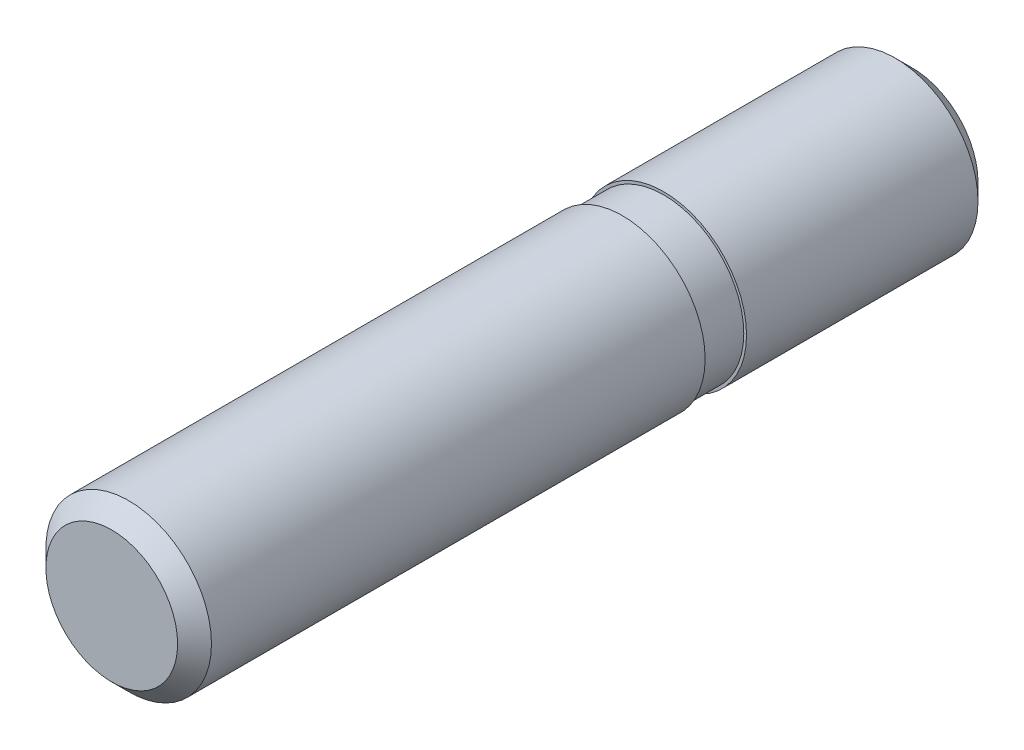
ISO-10303-21;
HEADER;
FILE_DESCRIPTION(('STEP AP214'),'2;1');
FILE_NAME('part.step','',(''),(''),'','','');
FILE_SCHEMA(('AUTOMOTIVE_DESIGN { 1 0 10303 214 1 1 1 1 }'));
ENDSEC;
DATA;
#1=APPLICATION_CONTEXT('core data for automotive mechanical design processes');
#2=APPLICATION_PROTOCOL_DEFINITION('international standard','automotive_design',2000,#1);
#3=PRODUCT_CONTEXT('',#1,'mechanical');
#4=PRODUCT('Part','Part','',(#3));
#5=PRODUCT_RELATED_PRODUCT_CATEGORY('part','',(#4));
#6=PRODUCT_DEFINITION_FORMATION('','',#4);
#7=PRODUCT_DEFINITION_CONTEXT('part definition',#1,'design');
#8=PRODUCT_DEFINITION('design','',#6,#7);
#9=PRODUCT_DEFINITION_SHAPE('','',#8);
#10=(LENGTH_UNIT() NAMED_UNIT(*) SI_UNIT(.MILLI.,.METRE.));
#11=(NAMED_UNIT(*) PLANE_ANGLE_UNIT() SI_UNIT($,.RADIAN.));
#12=(NAMED_UNIT(*) SI_UNIT($,.STERADIAN.) SOLID_ANGLE_UNIT());
#13=UNCERTAINTY_MEASURE_WITH_UNIT(LENGTH_MEASURE(1.E-05),#10,'distance_accuracy_value','');
#14=(GEOMETRIC_REPRESENTATION_CONTEXT(3) GLOBAL_UNCERTAINTY_ASSIGNED_CONTEXT((#13)) GLOBAL_UNIT_ASSIGNED_CONTEXT((#10,
#11,#12)) REPRESENTATION_CONTEXT('',''));
#15=CARTESIAN_POINT('',(0.,0.,0.));
#16=DIRECTION('',(0.,0.,1.));
#17=DIRECTION('',(1.,0.,0.));
#18=AXIS2_PLACEMENT_3D('',#15,#16,#17);
#19=CARTESIAN_POINT('',(0.,0.,6.25));
#20=DIRECTION('',(0.,0.,1.));
#21=DIRECTION('',(1.,0.,0.));
#22=AXIS2_PLACEMENT_3D('',#19,#20,#21);
#23=CYLINDRICAL_SURFACE('',#22,3.);
#24=CARTESIAN_POINT('',(0.,0.,19.3865));
#25=DIRECTION('',(0.,0.,1.));
#26=DIRECTION('',(1.,0.,0.));
#27=AXIS2_PLACEMENT_3D('',#24,#25,#26);
#28=CIRCLE('',#27,3.);
#29=CARTESIAN_POINT('',(3.,0.,19.3865));
#30=VERTEX_POINT('',#29);
#31=EDGE_CURVE('E18',#30,#30,#28,.F.);
#32=ORIENTED_EDGE('',*,*,#31,.T.);
#33=EDGE_LOOP('',(#32));
#34=FACE_BOUND('',#33,.T.);
#35=CARTESIAN_POINT('',(0.,0.,1.5));
#36=DIRECTION('',(0.,0.,1.));
#37=DIRECTION('',(1.,0.,0.));
#38=AXIS2_PLACEMENT_3D('',#35,#36,#37);
#39=CIRCLE('',#38,3.);
#40=CARTESIAN_POINT('',(3.,0.,1.5));
#41=VERTEX_POINT('',#40);
#42=EDGE_CURVE('E26',#41,#41,#39,.T.);
#43=ORIENTED_EDGE('',*,*,#42,.T.);
#44=EDGE_LOOP('',(#43));
#45=FACE_BOUND('',#44,.T.);
#46=ADVANCED_FACE('F12',(#34,#45),#23,.T.);
#47=CARTESIAN_POINT('',(0.,0.,1.5));
#48=DIRECTION('',(0.,0.,1.));
#49=DIRECTION('',(1.,0.,0.));
#50=AXIS2_PLACEMENT_3D('',#47,#48,#49);
#51=PLANE('',#50);
#52=CARTESIAN_POINT('',(0.,0.,1.5));
#53=DIRECTION('',(0.,0.,-1.));
#54=DIRECTION('',(-1.,0.,0.));
#55=AXIS2_PLACEMENT_3D('',#52,#53,#54);
#56=CIRCLE('',#55,2.9);
#57=CARTESIAN_POINT('',(-2.9,0.,1.5));
#58=VERTEX_POINT('',#57);
#59=EDGE_CURVE('E33',#58,#58,#56,.T.);
#60=ORIENTED_EDGE('',*,*,#59,.F.);
#61=EDGE_LOOP('',(#60));
#62=FACE_BOUND('',#61,.T.);
#63=ORIENTED_EDGE('',*,*,#42,.F.);
#64=EDGE_LOOP('',(#63));
#65=FACE_BOUND('',#64,.T.);
#66=ADVANCED_FACE('F46',(#62,#65),#51,.F.);
#67=CARTESIAN_POINT('',(0.,0.,20.));
#68=DIRECTION('',(0.,0.,1.));
#69=DIRECTION('',(1.,0.,0.));
#70=AXIS2_PLACEMENT_3D('',#67,#68,#69);
#71=PLANE('',#70);
#72=CARTESIAN_POINT('',(0.,0.,20.));
#73=DIRECTION('',(0.,0.,1.));
#74=DIRECTION('',(1.,0.,0.));
#75=AXIS2_PLACEMENT_3D('',#72,#73,#74);
#76=CIRCLE('',#75,2.3865);
#77=CARTESIAN_POINT('',(2.3865,0.,20.));
#78=VERTEX_POINT('',#77);
#79=EDGE_CURVE('E22',#78,#78,#76,.T.);
#80=ORIENTED_EDGE('',*,*,#79,.T.);
#81=EDGE_LOOP('',(#80));
#82=FACE_BOUND('',#81,.T.);
#83=ADVANCED_FACE('F49',(#82),#71,.T.);
#84=CARTESIAN_POINT('',(0.,0.,20.));
#85=DIRECTION('',(0.,0.,-1.));
#86=DIRECTION('',(-1.,0.,0.));
#87=AXIS2_PLACEMENT_3D('',#84,#85,#86);
#88=CONICAL_SURFACE('',#87,2.3865,0.785398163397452);
#89=ORIENTED_EDGE('',*,*,#31,.F.);
#90=EDGE_LOOP('',(#89));
#91=FACE_BOUND('',#90,.T.);
#92=ORIENTED_EDGE('',*,*,#79,.F.);
#93=EDGE_LOOP('',(#92));
#94=FACE_BOUND('',#93,.T.);
#95=ADVANCED_FACE('F72',(#91,#94),#88,.T.);
#96=CARTESIAN_POINT('',(0.,0.,-2.51140945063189));
#97=DIRECTION('',(0.,0.,-1.));
#98=DIRECTION('',(-1.,0.,0.));
#99=AXIS2_PLACEMENT_3D('',#96,#97,#98);
#100=CYLINDRICAL_SURFACE('',#99,2.9);
#101=ORIENTED_EDGE('',*,*,#59,.T.);
#102=EDGE_LOOP('',(#101));
#103=FACE_BOUND('',#102,.T.);
#104=CARTESIAN_POINT('',(0.,0.,0.));
#105=DIRECTION('',(0.,0.,1.));
#106=DIRECTION('',(1.,0.,0.));
#107=AXIS2_PLACEMENT_3D('',#104,#105,#106);
#108=CIRCLE('',#107,2.9);
#109=CARTESIAN_POINT('',(2.9,0.,0.));
#110=VERTEX_POINT('',#109);
#111=EDGE_CURVE('E8',#110,#110,#108,.T.);
#112=ORIENTED_EDGE('',*,*,#111,.T.);
#113=EDGE_LOOP('',(#112));
#114=FACE_BOUND('',#113,.T.);
#115=ADVANCED_FACE('F44',(#103,#114),#100,.T.);
#116=CARTESIAN_POINT('',(0.,1.19325,-9.));
#117=DIRECTION('',(0.,0.,-1.));
#118=DIRECTION('',(-1.,0.,0.));
#119=AXIS2_PLACEMENT_3D('',#116,#117,#118);
#120=PLANE('',#119);
#121=CARTESIAN_POINT('',(0.,0.,-9.));
#122=DIRECTION('',(0.,0.,1.));
#123=DIRECTION('',(1.,0.,0.));
#124=AXIS2_PLACEMENT_3D('',#121,#122,#123);
#125=CIRCLE('',#124,2.38649999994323);
#126=CARTESIAN_POINT('',(2.38649999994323,0.,-9.));
#127=VERTEX_POINT('',#126);
#128=EDGE_CURVE('E29',#127,#127,#125,.T.);
#129=ORIENTED_EDGE('',*,*,#128,.F.);
#130=EDGE_LOOP('',(#129));
#131=FACE_BOUND('',#130,.T.);
#132=ADVANCED_FACE('F89',(#131),#120,.T.);
#133=CARTESIAN_POINT('',(0.,0.,-8.38649999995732));
#134=DIRECTION('',(0.,0.,1.));
#135=DIRECTION('',(1.,0.,0.));
#136=AXIS2_PLACEMENT_3D('',#133,#134,#135);
#137=CONICAL_SURFACE('',#136,2.99999999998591,0.785398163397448);
#138=CARTESIAN_POINT('',(0.,0.,-8.3865));
#139=DIRECTION('',(0.,0.,1.));
#140=DIRECTION('',(1.,0.,0.));
#141=AXIS2_PLACEMENT_3D('',#138,#139,#140);
#142=CIRCLE('',#141,3.);
#143=CARTESIAN_POINT('',(3.,0.,-8.3865));
#144=VERTEX_POINT('',#143);
#145=EDGE_CURVE('E32',#144,#144,#142,.T.);
#146=ORIENTED_EDGE('',*,*,#145,.F.);
#147=EDGE_LOOP('',(#146));
#148=FACE_BOUND('',#147,.T.);
#149=ORIENTED_EDGE('',*,*,#128,.T.);
#150=EDGE_LOOP('',(#149));
#151=FACE_BOUND('',#150,.T.);
#152=ADVANCED_FACE('F97',(#148,#151),#137,.T.);
#153=CARTESIAN_POINT('',(0.,0.,6.25));
#154=DIRECTION('',(0.,0.,1.));
#155=DIRECTION('',(1.,0.,0.));
#156=AXIS2_PLACEMENT_3D('',#153,#154,#155);
#157=CYLINDRICAL_SURFACE('',#156,3.);
#158=CARTESIAN_POINT('',(0.,0.,0.));
#159=DIRECTION('',(0.,0.,1.));
#160=DIRECTION('',(1.,0.,0.));
#161=AXIS2_PLACEMENT_3D('',#158,#159,#160);
#162=CIRCLE('',#161,3.);
#163=CARTESIAN_POINT('',(3.,0.,0.));
#164=VERTEX_POINT('',#163);
#165=EDGE_CURVE('E34',#164,#164,#162,.T.);
#166=ORIENTED_EDGE('',*,*,#165,.F.);
#167=EDGE_LOOP('',(#166));
#168=FACE_BOUND('',#167,.T.);
#169=ORIENTED_EDGE('',*,*,#145,.T.);
#170=EDGE_LOOP('',(#169));
#171=FACE_BOUND('',#170,.T.);
#172=ADVANCED_FACE('F106',(#168,#171),#157,.T.);
#173=CARTESIAN_POINT('',(0.,0.,0.));
#174=DIRECTION('',(0.,0.,1.));
#175=DIRECTION('',(1.,0.,0.));
#176=AXIS2_PLACEMENT_3D('',#173,#174,#175);
#177=PLANE('',#176);
#178=ORIENTED_EDGE('',*,*,#111,.F.);
#179=EDGE_LOOP('',(#178));
#180=FACE_BOUND('',#179,.T.);
#181=ORIENTED_EDGE('',*,*,#165,.T.);
#182=EDGE_LOOP('',(#181));
#183=FACE_BOUND('',#182,.T.);
#184=ADVANCED_FACE('F115',(#180,#183),#177,.T.);
#185=CLOSED_SHELL('',(#46,#66,#83,#95,#115,#132,#152,#172,#184));
#186=MANIFOLD_SOLID_BREP('B1',#185);
#187=ADVANCED_BREP_SHAPE_REPRESENTATION('',(#18,#186),#14);
#188=SHAPE_DEFINITION_REPRESENTATION(#9,#187);
ENDSEC;
END-ISO-10303-21;
